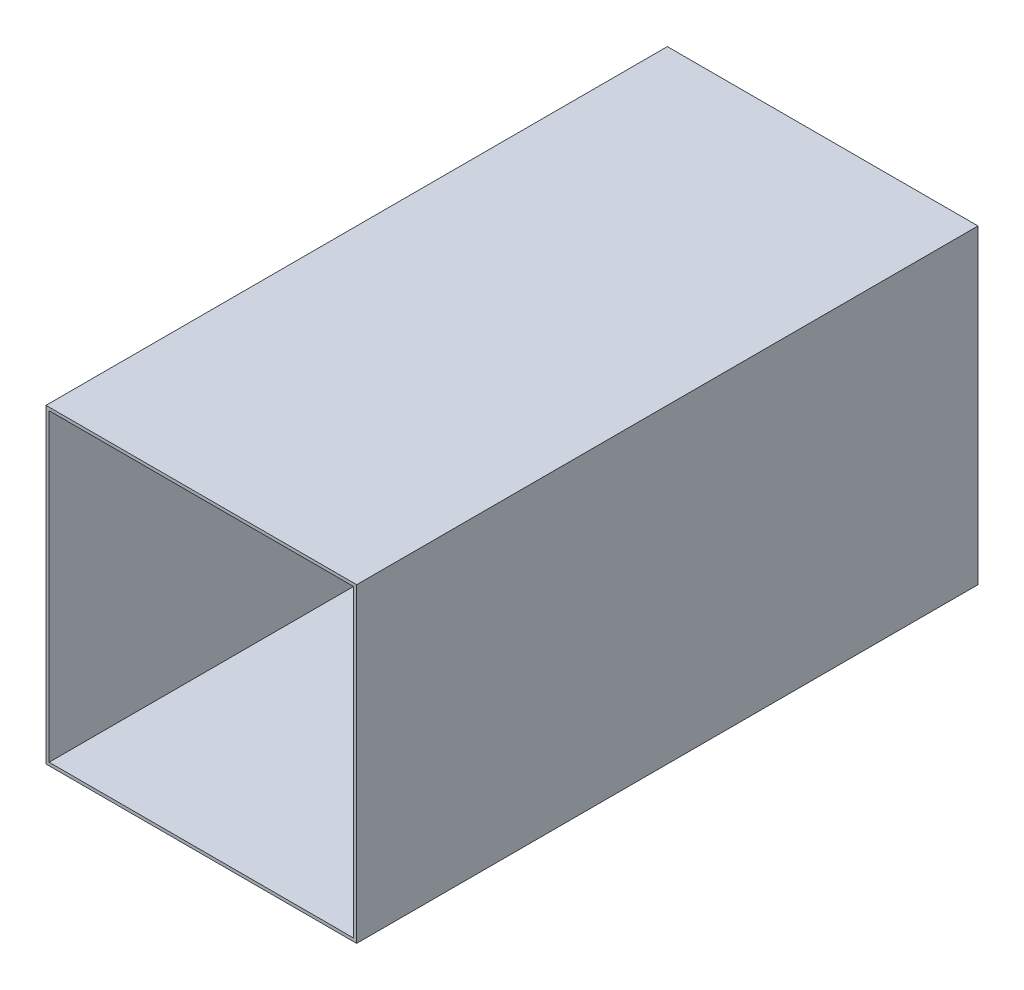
from build123d import *

# Parameters (mm, degrees)
SKETCH1_W           = 254
SKETCH1_H           = 254
SKETCH1_W_2         = 248.92
SKETCH1_H_2         = 248.92
BOSS_EXTRUDE1_DEPTH = 254


with BuildPart() as part:
    # Sketch1 → Boss-Extrude1 (new, symmetric)
    with BuildSketch(Plane.XY):
        with Locations((127, 127)):
            Rectangle(SKETCH1_W, SKETCH1_H)
        with Locations((127, 127)):
            Rectangle(SKETCH1_W_2, SKETCH1_H_2, mode=Mode.SUBTRACT)
    extrude(amount=BOSS_EXTRUDE1_DEPTH, both=True)


solid = part.part
